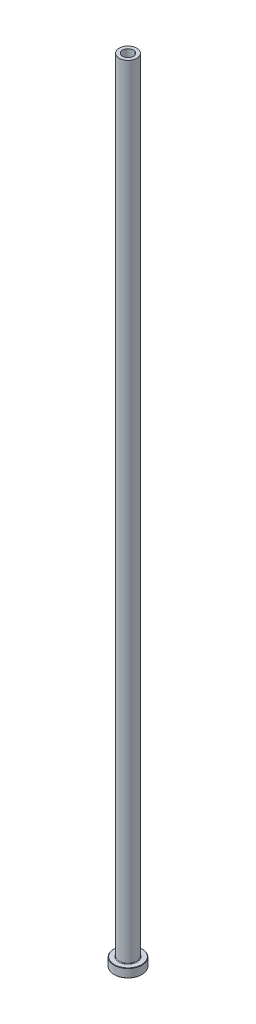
ISO-10303-21;
HEADER;
FILE_DESCRIPTION(('STEP AP214'),'2;1');
FILE_NAME('part.step','',(''),(''),'','','');
FILE_SCHEMA(('AUTOMOTIVE_DESIGN { 1 0 10303 214 1 1 1 1 }'));
ENDSEC;
DATA;
#1=APPLICATION_CONTEXT('core data for automotive mechanical design processes');
#2=APPLICATION_PROTOCOL_DEFINITION('international standard','automotive_design',2000,#1);
#3=PRODUCT_CONTEXT('',#1,'mechanical');
#4=PRODUCT('Part','Part','',(#3));
#5=PRODUCT_RELATED_PRODUCT_CATEGORY('part','',(#4));
#6=PRODUCT_DEFINITION_FORMATION('','',#4);
#7=PRODUCT_DEFINITION_CONTEXT('part definition',#1,'design');
#8=PRODUCT_DEFINITION('design','',#6,#7);
#9=PRODUCT_DEFINITION_SHAPE('','',#8);
#10=(LENGTH_UNIT() NAMED_UNIT(*) SI_UNIT(.MILLI.,.METRE.));
#11=(NAMED_UNIT(*) PLANE_ANGLE_UNIT() SI_UNIT($,.RADIAN.));
#12=(NAMED_UNIT(*) SI_UNIT($,.STERADIAN.) SOLID_ANGLE_UNIT());
#13=UNCERTAINTY_MEASURE_WITH_UNIT(LENGTH_MEASURE(1.E-05),#10,'distance_accuracy_value','');
#14=(GEOMETRIC_REPRESENTATION_CONTEXT(3) GLOBAL_UNCERTAINTY_ASSIGNED_CONTEXT((#13)) GLOBAL_UNIT_ASSIGNED_CONTEXT((#10,
#11,#12)) REPRESENTATION_CONTEXT('',''));
#15=CARTESIAN_POINT('',(0.,0.,0.));
#16=DIRECTION('',(0.,0.,1.));
#17=DIRECTION('',(1.,0.,0.));
#18=AXIS2_PLACEMENT_3D('',#15,#16,#17);
#19=CARTESIAN_POINT('',(0.,92.1876809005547,0.));
#20=DIRECTION('',(0.,1.,0.));
#21=DIRECTION('',(0.,0.,1.));
#22=AXIS2_PLACEMENT_3D('',#19,#20,#21);
#23=CYLINDRICAL_SURFACE('',#22,3.10000000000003);
#24=CARTESIAN_POINT('',(0.,450.,0.));
#25=DIRECTION('',(0.,1.,0.));
#26=DIRECTION('',(0.,0.,1.));
#27=AXIS2_PLACEMENT_3D('',#24,#25,#26);
#28=CIRCLE('',#27,3.10000000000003);
#29=CARTESIAN_POINT('',(0.,450.,3.10000000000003));
#30=VERTEX_POINT('',#29);
#31=EDGE_CURVE('E62',#30,#30,#28,.T.);
#32=ORIENTED_EDGE('',*,*,#31,.T.);
#33=EDGE_LOOP('',(#32));
#34=FACE_BOUND('',#33,.T.);
#35=CARTESIAN_POINT('',(0.,405.,0.));
#36=DIRECTION('',(0.,1.,0.));
#37=DIRECTION('',(0.,0.,1.));
#38=AXIS2_PLACEMENT_3D('',#35,#36,#37);
#39=CIRCLE('',#38,3.10000000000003);
#40=CARTESIAN_POINT('',(0.,405.,3.10000000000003));
#41=VERTEX_POINT('',#40);
#42=EDGE_CURVE('E71',#41,#41,#39,.T.);
#43=ORIENTED_EDGE('',*,*,#42,.F.);
#44=EDGE_LOOP('',(#43));
#45=FACE_BOUND('',#44,.T.);
#46=ADVANCED_FACE('F30',(#34,#45),#23,.F.);
#47=CARTESIAN_POINT('',(-3.10000000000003,450.,0.));
#48=DIRECTION('',(0.,1.,0.));
#49=DIRECTION('',(0.,0.,1.));
#50=AXIS2_PLACEMENT_3D('',#47,#48,#49);
#51=PLANE('',#50);
#52=CARTESIAN_POINT('',(0.,450.,0.));
#53=DIRECTION('',(0.,1.,0.));
#54=DIRECTION('',(0.,0.,1.));
#55=AXIS2_PLACEMENT_3D('',#52,#53,#54);
#56=CIRCLE('',#55,5.00000000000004);
#57=CARTESIAN_POINT('',(0.,450.,5.00000000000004));
#58=VERTEX_POINT('',#57);
#59=EDGE_CURVE('E65',#58,#58,#56,.T.);
#60=ORIENTED_EDGE('',*,*,#59,.T.);
#61=EDGE_LOOP('',(#60));
#62=FACE_BOUND('',#61,.T.);
#63=ORIENTED_EDGE('',*,*,#31,.F.);
#64=EDGE_LOOP('',(#63));
#65=FACE_BOUND('',#64,.T.);
#66=ADVANCED_FACE('F79',(#62,#65),#51,.T.);
#67=CARTESIAN_POINT('',(0.,92.1876809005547,0.));
#68=DIRECTION('',(0.,1.,0.));
#69=DIRECTION('',(0.,0.,1.));
#70=AXIS2_PLACEMENT_3D('',#67,#68,#69);
#71=CYLINDRICAL_SURFACE('',#70,5.00000000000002);
#72=CARTESIAN_POINT('',(0.,5.3,0.));
#73=DIRECTION('',(0.,1.,0.));
#74=DIRECTION('',(0.,0.,1.));
#75=AXIS2_PLACEMENT_3D('',#72,#73,#74);
#76=CIRCLE('',#75,5.00000000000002);
#77=CARTESIAN_POINT('',(0.,5.3,5.00000000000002));
#78=VERTEX_POINT('',#77);
#79=EDGE_CURVE('E59',#78,#78,#76,.T.);
#80=ORIENTED_EDGE('',*,*,#79,.T.);
#81=EDGE_LOOP('',(#80));
#82=FACE_BOUND('',#81,.T.);
#83=ORIENTED_EDGE('',*,*,#59,.F.);
#84=EDGE_LOOP('',(#83));
#85=FACE_BOUND('',#84,.T.);
#86=ADVANCED_FACE('F85',(#82,#85),#71,.T.);
#87=CARTESIAN_POINT('',(-4.99999999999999,5.,0.));
#88=DIRECTION('',(0.,1.,0.));
#89=DIRECTION('',(0.,0.,1.));
#90=AXIS2_PLACEMENT_3D('',#87,#88,#89);
#91=PLANE('',#90);
#92=CARTESIAN_POINT('',(0.,5.,0.));
#93=DIRECTION('',(0.,1.,0.));
#94=DIRECTION('',(0.,0.,1.));
#95=AXIS2_PLACEMENT_3D('',#92,#93,#94);
#96=CIRCLE('',#95,7.80000000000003);
#97=CARTESIAN_POINT('',(0.,5.,7.80000000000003));
#98=VERTEX_POINT('',#97);
#99=EDGE_CURVE('E53',#98,#98,#96,.T.);
#100=ORIENTED_EDGE('',*,*,#99,.T.);
#101=EDGE_LOOP('',(#100));
#102=FACE_BOUND('',#101,.T.);
#103=CARTESIAN_POINT('',(0.,5.,0.));
#104=DIRECTION('',(0.,1.,0.));
#105=DIRECTION('',(0.,0.,1.));
#106=AXIS2_PLACEMENT_3D('',#103,#104,#105);
#107=CIRCLE('',#106,5.30000000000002);
#108=CARTESIAN_POINT('',(0.,5.,5.30000000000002));
#109=VERTEX_POINT('',#108);
#110=EDGE_CURVE('E56',#109,#109,#107,.F.);
#111=ORIENTED_EDGE('',*,*,#110,.T.);
#112=EDGE_LOOP('',(#111));
#113=FACE_BOUND('',#112,.T.);
#114=ADVANCED_FACE('F111',(#102,#113),#91,.T.);
#115=CARTESIAN_POINT('',(0.,92.1876809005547,0.));
#116=DIRECTION('',(0.,1.,0.));
#117=DIRECTION('',(0.,0.,1.));
#118=AXIS2_PLACEMENT_3D('',#115,#116,#117);
#119=CYLINDRICAL_SURFACE('',#118,7.99999999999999);
#120=CARTESIAN_POINT('',(0.,4.80000000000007,0.));
#121=DIRECTION('',(0.,1.,0.));
#122=DIRECTION('',(0.,0.,1.));
#123=AXIS2_PLACEMENT_3D('',#120,#121,#122);
#124=CIRCLE('',#123,7.99999999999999);
#125=CARTESIAN_POINT('',(0.,4.80000000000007,7.99999999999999));
#126=VERTEX_POINT('',#125);
#127=EDGE_CURVE('E45',#126,#126,#124,.F.);
#128=ORIENTED_EDGE('',*,*,#127,.T.);
#129=EDGE_LOOP('',(#128));
#130=FACE_BOUND('',#129,.T.);
#131=CARTESIAN_POINT('',(0.,0.200000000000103,0.));
#132=DIRECTION('',(0.,-1.,0.));
#133=DIRECTION('',(0.,0.,-1.));
#134=AXIS2_PLACEMENT_3D('',#131,#132,#133);
#135=CIRCLE('',#134,7.99999999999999);
#136=CARTESIAN_POINT('',(0.,0.200000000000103,-7.99999999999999));
#137=VERTEX_POINT('',#136);
#138=EDGE_CURVE('E50',#137,#137,#135,.F.);
#139=ORIENTED_EDGE('',*,*,#138,.T.);
#140=EDGE_LOOP('',(#139));
#141=FACE_BOUND('',#140,.T.);
#142=ADVANCED_FACE('F108',(#130,#141),#119,.T.);
#143=CARTESIAN_POINT('',(-7.99999999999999,0.,0.));
#144=DIRECTION('',(0.,-1.,0.));
#145=DIRECTION('',(0.,0.,-1.));
#146=AXIS2_PLACEMENT_3D('',#143,#144,#145);
#147=PLANE('',#146);
#148=CARTESIAN_POINT('',(0.,0.,0.));
#149=DIRECTION('',(0.,-1.,0.));
#150=DIRECTION('',(0.,0.,-1.));
#151=AXIS2_PLACEMENT_3D('',#148,#149,#150);
#152=CIRCLE('',#151,3.84999999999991);
#153=CARTESIAN_POINT('',(0.,0.,-3.84999999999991));
#154=VERTEX_POINT('',#153);
#155=EDGE_CURVE('E37',#154,#154,#152,.F.);
#156=ORIENTED_EDGE('',*,*,#155,.T.);
#157=EDGE_LOOP('',(#156));
#158=FACE_BOUND('',#157,.T.);
#159=CARTESIAN_POINT('',(0.,0.,0.));
#160=DIRECTION('',(0.,-1.,0.));
#161=DIRECTION('',(0.,0.,-1.));
#162=AXIS2_PLACEMENT_3D('',#159,#160,#161);
#163=CIRCLE('',#162,7.79999999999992);
#164=CARTESIAN_POINT('',(0.,0.,-7.79999999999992));
#165=VERTEX_POINT('',#164);
#166=EDGE_CURVE('E41',#165,#165,#163,.T.);
#167=ORIENTED_EDGE('',*,*,#166,.T.);
#168=EDGE_LOOP('',(#167));
#169=FACE_BOUND('',#168,.T.);
#170=ADVANCED_FACE('F110',(#158,#169),#147,.T.);
#171=CARTESIAN_POINT('',(0.,92.1876809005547,0.));
#172=DIRECTION('',(0.,1.,0.));
#173=DIRECTION('',(0.,0.,1.));
#174=AXIS2_PLACEMENT_3D('',#171,#172,#173);
#175=CYLINDRICAL_SURFACE('',#174,3.35000000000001);
#176=CARTESIAN_POINT('',(0.,0.499999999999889,0.));
#177=DIRECTION('',(0.,-1.,0.));
#178=DIRECTION('',(0.,0.,-1.));
#179=AXIS2_PLACEMENT_3D('',#176,#177,#178);
#180=CIRCLE('',#179,3.35000000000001);
#181=CARTESIAN_POINT('',(0.,0.499999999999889,-3.35000000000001));
#182=VERTEX_POINT('',#181);
#183=EDGE_CURVE('E10',#182,#182,#180,.T.);
#184=ORIENTED_EDGE('',*,*,#183,.T.);
#185=EDGE_LOOP('',(#184));
#186=FACE_BOUND('',#185,.T.);
#187=CARTESIAN_POINT('',(0.,393.,0.));
#188=DIRECTION('',(0.,1.,0.));
#189=DIRECTION('',(0.,0.,1.));
#190=AXIS2_PLACEMENT_3D('',#187,#188,#189);
#191=CIRCLE('',#190,3.35000000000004);
#192=CARTESIAN_POINT('',(0.,393.,3.35000000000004));
#193=VERTEX_POINT('',#192);
#194=EDGE_CURVE('E68',#193,#193,#191,.T.);
#195=ORIENTED_EDGE('',*,*,#194,.T.);
#196=EDGE_LOOP('',(#195));
#197=FACE_BOUND('',#196,.T.);
#198=ADVANCED_FACE('F118',(#186,#197),#175,.F.);
#199=CARTESIAN_POINT('',(0.,393.,0.));
#200=DIRECTION('',(0.,-1.,0.));
#201=DIRECTION('',(0.,0.,-1.));
#202=AXIS2_PLACEMENT_3D('',#199,#200,#201);
#203=CONICAL_SURFACE('',#202,3.35000000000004,0.0208303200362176);
#204=ORIENTED_EDGE('',*,*,#42,.T.);
#205=EDGE_LOOP('',(#204));
#206=FACE_BOUND('',#205,.T.);
#207=ORIENTED_EDGE('',*,*,#194,.F.);
#208=EDGE_LOOP('',(#207));
#209=FACE_BOUND('',#208,.T.);
#210=ADVANCED_FACE('F75',(#206,#209),#203,.F.);
#211=CARTESIAN_POINT('',(0.,5.3,0.));
#212=DIRECTION('',(0.,1.,0.));
#213=DIRECTION('',(0.,0.,1.));
#214=AXIS2_PLACEMENT_3D('',#211,#212,#213);
#215=TOROIDAL_SURFACE('',#214,5.30000000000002,0.3);
#216=ORIENTED_EDGE('',*,*,#110,.F.);
#217=EDGE_LOOP('',(#216));
#218=FACE_BOUND('',#217,.T.);
#219=ORIENTED_EDGE('',*,*,#79,.F.);
#220=EDGE_LOOP('',(#219));
#221=FACE_BOUND('',#220,.T.);
#222=ADVANCED_FACE('F90',(#218,#221),#215,.F.);
#223=CARTESIAN_POINT('',(0.,5.,0.));
#224=DIRECTION('',(0.,-1.,0.));
#225=DIRECTION('',(0.,0.,-1.));
#226=AXIS2_PLACEMENT_3D('',#223,#224,#225);
#227=CONICAL_SURFACE('',#226,7.80000000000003,0.785398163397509);
#228=ORIENTED_EDGE('',*,*,#127,.F.);
#229=EDGE_LOOP('',(#228));
#230=FACE_BOUND('',#229,.T.);
#231=ORIENTED_EDGE('',*,*,#99,.F.);
#232=EDGE_LOOP('',(#231));
#233=FACE_BOUND('',#232,.T.);
#234=ADVANCED_FACE('F93',(#230,#233),#227,.T.);
#235=CARTESIAN_POINT('',(0.,0.200000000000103,0.));
#236=DIRECTION('',(0.,1.,0.));
#237=DIRECTION('',(0.,0.,1.));
#238=AXIS2_PLACEMENT_3D('',#235,#236,#237);
#239=CONICAL_SURFACE('',#238,7.99999999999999,0.78539816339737);
#240=ORIENTED_EDGE('',*,*,#166,.F.);
#241=EDGE_LOOP('',(#240));
#242=FACE_BOUND('',#241,.T.);
#243=ORIENTED_EDGE('',*,*,#138,.F.);
#244=EDGE_LOOP('',(#243));
#245=FACE_BOUND('',#244,.T.);
#246=ADVANCED_FACE('F96',(#242,#245),#239,.T.);
#247=CARTESIAN_POINT('',(0.,0.,0.));
#248=DIRECTION('',(0.,-1.,0.));
#249=DIRECTION('',(0.,0.,-1.));
#250=AXIS2_PLACEMENT_3D('',#247,#248,#249);
#251=CONICAL_SURFACE('',#250,3.84999999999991,0.785398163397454);
#252=ORIENTED_EDGE('',*,*,#183,.F.);
#253=EDGE_LOOP('',(#252));
#254=FACE_BOUND('',#253,.T.);
#255=ORIENTED_EDGE('',*,*,#155,.F.);
#256=EDGE_LOOP('',(#255));
#257=FACE_BOUND('',#256,.T.);
#258=ADVANCED_FACE('F32',(#254,#257),#251,.F.);
#259=CLOSED_SHELL('',(#46,#66,#86,#114,#142,#170,#198,#210,#222,#234,#246,#258));
#260=MANIFOLD_SOLID_BREP('B2',#259);
#261=ADVANCED_BREP_SHAPE_REPRESENTATION('',(#18,#260),#14);
#262=SHAPE_DEFINITION_REPRESENTATION(#9,#261);
ENDSEC;
END-ISO-10303-21;
